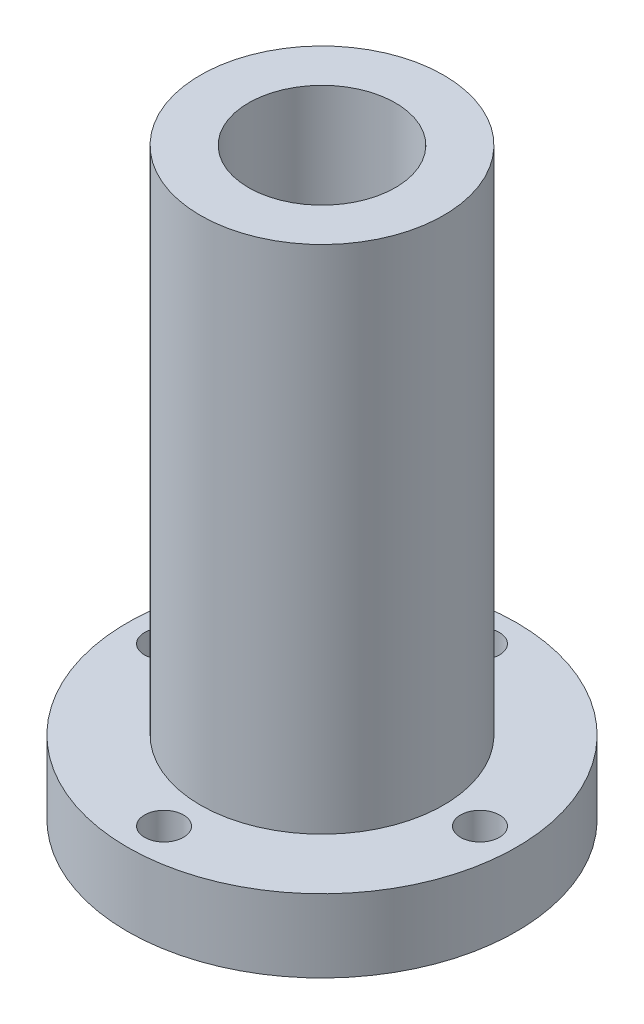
from build123d import *

# Parameters (mm, degrees)
SKETCH1_R          = 25.4
EXTRUDE1_DEPTH     = 76.2
SKETCH2_R          = 9.5885
CUT_EXTRUDE1_DEPTH = 85.242269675
SKETCH3_OUTSIDE_W  = 73.746
SKETCH3_OUTSIDE_H  = 73.746
SKETCH3_OUTSIDE_R  = 15.875
CUT_EXTRUDE2_DEPTH = 66.675
SKETCH4_R          = 2.54
CUT_EXTRUDE3_DEPTH = 76.735563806


with BuildPart() as part:
    # Sketch1 → Extrude1 (new body)
    with BuildSketch(Plane(origin=(0, 0, 0), x_dir=(1, 0, 0), z_dir=(0, 1, 0))):
        with Locations(Location((0, 0, 0), (0, 0, 270))):
            Circle(SKETCH1_R)
    extrude(amount=-EXTRUDE1_DEPTH)

    # Sketch2 → Cut-Extrude1 (cut, through all)
    with BuildSketch(Plane(origin=(0, 0, 0), x_dir=(-1, 0, 0), z_dir=(0, 1, 0))):
        with Locations(Location((0, 0, 0), (0, 0, 90))):
            Circle(SKETCH2_R)
    extrude(amount=-CUT_EXTRUDE1_DEPTH, mode=Mode.SUBTRACT)

    # Sketch3 outside → Cut-Extrude2 (cut)
    with BuildSketch(Plane(origin=(0, 0, 0), x_dir=(-1, 0, 0), z_dir=(0, 1, 0))):
        Rectangle(SKETCH3_OUTSIDE_W, SKETCH3_OUTSIDE_H)
        with Locations(Location((0, 0, 0), (0, 0, 90))):
            Circle(SKETCH3_OUTSIDE_R, mode=Mode.SUBTRACT)
    extrude(amount=-CUT_EXTRUDE2_DEPTH, mode=Mode.SUBTRACT)

    # Sketch4 → Cut-Extrude3 (cut, through all)
    with BuildSketch(Plane(origin=(0, -66.675, 0), x_dir=(-1, 0, 0), z_dir=(0, 1, 0))):
        with Locations(Location((0, -20.6248, 0), (0, 0, 90))):
            Circle(SKETCH4_R)
        with Locations(Location((0, 20.6248, 0), (0, 0, 90))):
            Circle(SKETCH4_R)
        with Locations(Location((-20.6248, 0, 0), (0, 0, 90))):
            Circle(SKETCH4_R)
        with Locations(Location((20.6248, 0, 0), (0, 0, 90))):
            Circle(SKETCH4_R)
    extrude(amount=-CUT_EXTRUDE3_DEPTH, mode=Mode.SUBTRACT)


solid = part.part
